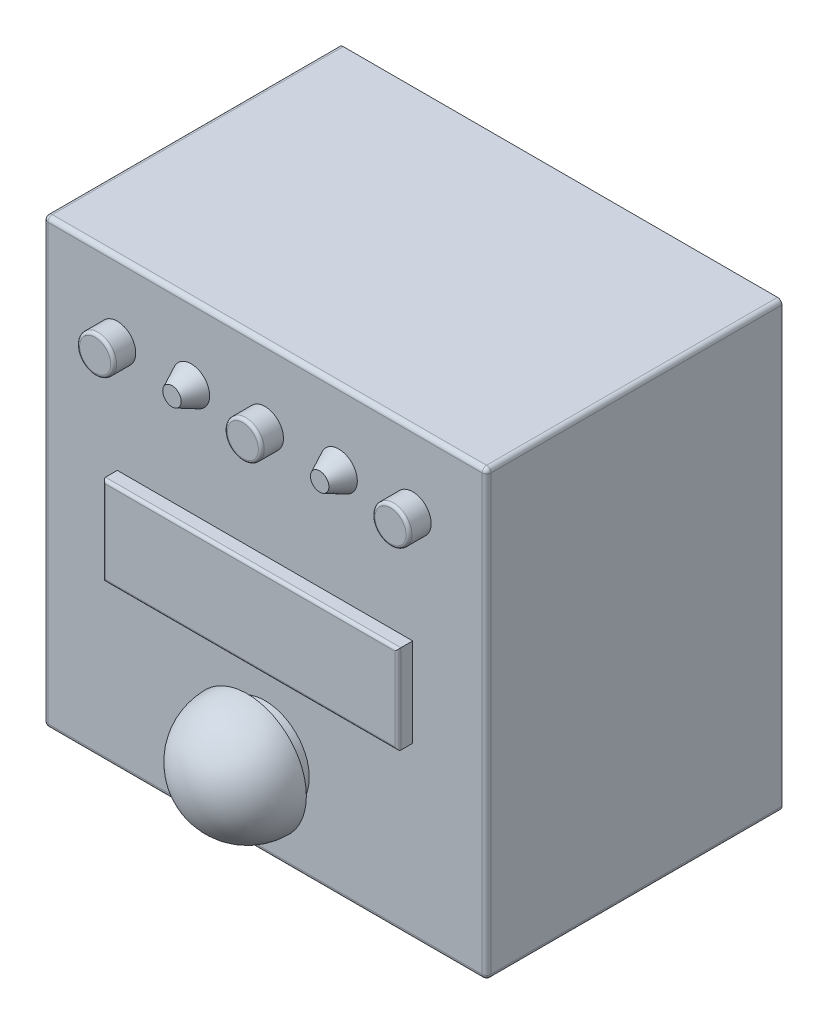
from build123d import *

# Parameters (mm, degrees)
ESQUISSE1_W                = 300
ESQUISSE1_H                = 300
EXTRUSION1_DEPTH           = 200
COQUE1_T                   = 5
ESQUISSE2_R                = 12.5
EXTRUSION2_DEPTH           = 15
CONG_1_R                   = 2
ESQUISSE3_W                = 200
ESQUISSE3_H                = 60
EXTRUSION3_DEPTH           = 10
CONG_2_R                   = 2
ESQUISSE4_R                = 30
EXTRUSION4_DEPTH           = 12
R_VOLUTION2_ANGLE          = 180
CONG_4_R                   = 3
R_P_TITION_LIN_AIRE2_COUNT = 2
R_P_TITION_LIN_AIRE2_PITCH = 100


with BuildPart() as part:
    # Esquisse1 → Extrusion1 (new body)
    with BuildSketch(Plane.XY):
        with Locations((150, 150)):
            Rectangle(ESQUISSE1_W, ESQUISSE1_H)
    extrude(amount=EXTRUSION1_DEPTH)

    # Coque1 (no face opened: a closed hollow body)
    add(offset(amount=-COQUE1_T, mode=Mode.PRIVATE), mode=Mode.SUBTRACT)

    # Esquisse2 → Extrusion2 (add)
    with BuildSketch(Plane.XY.offset(200)):
        with Locations(Location((50, 250, 0), (0, 0, 180))):
            Circle(ESQUISSE2_R)
        with Locations(Location((150, 250, 0), (0, 0, 180))):
            Circle(ESQUISSE2_R)
        with Locations(Location((250, 250, 0), (0, 0, 180))):
            Circle(ESQUISSE2_R)
    extrude(amount=EXTRUSION2_DEPTH)

    # Cong_1
    cong_1_edges = [part.edges().sort_by_distance(p)[0] for p in [
        (62.5, 250, 215),
        (162.5, 250, 215),
        (262.5, 250, 215),
    ]]
    fillet(cong_1_edges, radius=CONG_1_R)

    # Esquisse3 → Extrusion3 (add)
    with BuildSketch(Plane.XY.offset(200)):
        with Locations((150, 145)):
            Rectangle(ESQUISSE3_W, ESQUISSE3_H)
    extrude(amount=EXTRUSION3_DEPTH)

    # Cong_2
    cong_2_edges = [part.edges().sort_by_distance(p)[0] for p in [
        (50, 145, 210),
        (150, 115, 210),
        (250, 145, 210),
        (150, 175, 210),
    ]]
    fillet(cong_2_edges, radius=CONG_2_R)

    # Esquisse4 → Extrusion4 (add)
    with BuildSketch(Plane.XY.offset(200)):
        with Locations(Location((150, 60, 0), (0, 0, 180))):
            Circle(ESQUISSE4_R)
    extrude(amount=EXTRUSION4_DEPTH)

    # Esquisse5 → R_volution2 (revolve)
    with BuildSketch(Plane.XY.offset(212)):
        with BuildLine():
            Line((190, 60), (110, 60))
            ThreePointArc((110, 60), (150, 100), (190, 60))
        make_face()
    revolve(axis=Axis((190, 60, 212), (1, 0, 0)), revolution_arc=R_VOLUTION2_ANGLE)

    # Cong_4
    cong_4_edges = [part.edges().sort_by_distance(p)[0] for p in [
        (300, 150, 200),
        (150, 300, 200),
        (0, 150, 200),
        (150, 0, 200),
        (0, 300, 100),
        (300, 300, 100),
        (300, 0, 100),
        (0, 0, 100),
    ]]
    fillet(cong_4_edges, radius=CONG_4_R)

    # Esquisse6 → R_volution3 (revolve)
    with BuildSketch(Plane(origin=(100, 0, 0), x_dir=(0, 0, -1), z_dir=(1, 0, 0)), mode=Mode.PRIVATE) as r_volution3_sk:
        Polygon((-200, 250), (-200, 262.5), (-213, 256.25), (-213, 250), align=None)
    r_volution3 = revolve(r_volution3_sk.sketch.rotate(Axis((100, 250, 213), (0, 0, -1)), 270), axis=Axis((100, 250, 213), (0, 0, -1)))

    # R_p_tition lin_aire2: R_volution3 ×2
    with Locations(*[(i * R_P_TITION_LIN_AIRE2_PITCH, 0, 0) for i in range(1, R_P_TITION_LIN_AIRE2_COUNT)]):
        add(r_volution3)


solid = part.part
